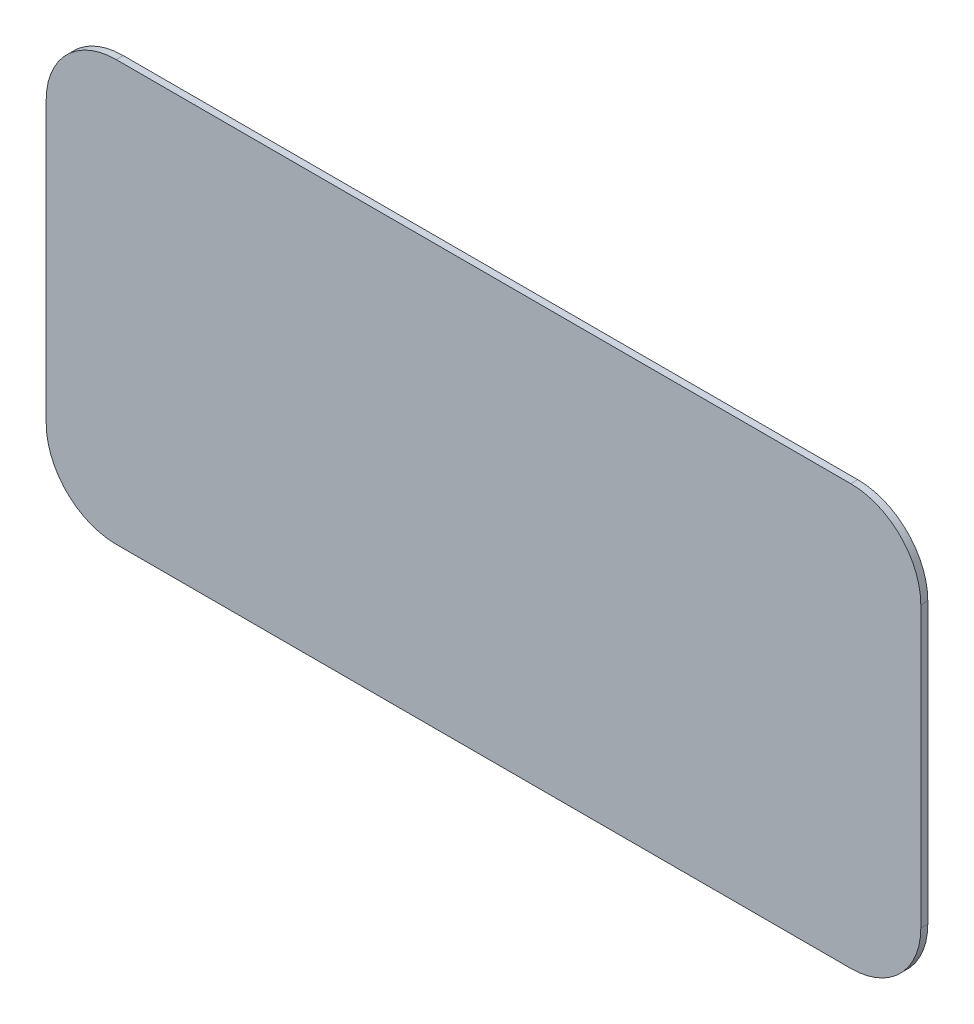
ISO-10303-21;
HEADER;
FILE_DESCRIPTION(('STEP AP214'),'2;1');
FILE_NAME('part.step','',(''),(''),'','','');
FILE_SCHEMA(('AUTOMOTIVE_DESIGN { 1 0 10303 214 1 1 1 1 }'));
ENDSEC;
DATA;
#1=APPLICATION_CONTEXT('core data for automotive mechanical design processes');
#2=APPLICATION_PROTOCOL_DEFINITION('international standard','automotive_design',2000,#1);
#3=PRODUCT_CONTEXT('',#1,'mechanical');
#4=PRODUCT('Part','Part','',(#3));
#5=PRODUCT_RELATED_PRODUCT_CATEGORY('part','',(#4));
#6=PRODUCT_DEFINITION_FORMATION('','',#4);
#7=PRODUCT_DEFINITION_CONTEXT('part definition',#1,'design');
#8=PRODUCT_DEFINITION('design','',#6,#7);
#9=PRODUCT_DEFINITION_SHAPE('','',#8);
#10=(LENGTH_UNIT() NAMED_UNIT(*) SI_UNIT(.MILLI.,.METRE.));
#11=(NAMED_UNIT(*) PLANE_ANGLE_UNIT() SI_UNIT($,.RADIAN.));
#12=(NAMED_UNIT(*) SI_UNIT($,.STERADIAN.) SOLID_ANGLE_UNIT());
#13=UNCERTAINTY_MEASURE_WITH_UNIT(LENGTH_MEASURE(1.E-05),#10,'distance_accuracy_value','');
#14=(GEOMETRIC_REPRESENTATION_CONTEXT(3) GLOBAL_UNCERTAINTY_ASSIGNED_CONTEXT((#13)) GLOBAL_UNIT_ASSIGNED_CONTEXT((#10,
#11,#12)) REPRESENTATION_CONTEXT('',''));
#15=CARTESIAN_POINT('',(0.,0.,0.));
#16=DIRECTION('',(0.,0.,1.));
#17=DIRECTION('',(1.,0.,0.));
#18=AXIS2_PLACEMENT_3D('',#15,#16,#17);
#19=CARTESIAN_POINT('',(-0.848822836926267,0.338176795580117,0.2));
#20=DIRECTION('',(0.,0.,-1.));
#21=DIRECTION('',(-1.,0.,0.));
#22=AXIS2_PLACEMENT_3D('',#19,#20,#21);
#23=CYLINDRICAL_SURFACE('',#22,2.);
#24=CARTESIAN_POINT('',(-0.848822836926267,0.338176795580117,0.));
#25=DIRECTION('',(0.,0.,1.));
#26=DIRECTION('',(-1.,0.,0.));
#27=AXIS2_PLACEMENT_3D('',#24,#25,#26);
#28=CIRCLE('',#27,2.);
#29=CARTESIAN_POINT('',(1.15117716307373,0.338176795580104,0.));
#30=VERTEX_POINT('',#29);
#31=CARTESIAN_POINT('',(-0.848822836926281,2.33817679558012,0.));
#32=VERTEX_POINT('',#31);
#33=EDGE_CURVE('E128',#30,#32,#28,.T.);
#34=ORIENTED_EDGE('',*,*,#33,.T.);
#35=DIRECTION('',(0.,0.,-1.));
#36=VECTOR('',#35,1.);
#37=CARTESIAN_POINT('',(-0.848822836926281,2.33817679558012,0.2));
#38=LINE('',#37,#36);
#39=CARTESIAN_POINT('',(-0.848822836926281,2.33817679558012,0.2));
#40=VERTEX_POINT('',#39);
#41=EDGE_CURVE('E11',#40,#32,#38,.T.);
#42=ORIENTED_EDGE('',*,*,#41,.F.);
#43=CARTESIAN_POINT('',(-0.848822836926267,0.338176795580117,0.2));
#44=DIRECTION('',(0.,0.,1.));
#45=DIRECTION('',(-1.,0.,0.));
#46=AXIS2_PLACEMENT_3D('',#43,#44,#45);
#47=CIRCLE('',#46,2.);
#48=CARTESIAN_POINT('',(1.15117716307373,0.338176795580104,0.2));
#49=VERTEX_POINT('',#48);
#50=EDGE_CURVE('E142',#49,#40,#47,.T.);
#51=ORIENTED_EDGE('',*,*,#50,.F.);
#52=DIRECTION('',(0.,0.,-1.));
#53=VECTOR('',#52,1.);
#54=CARTESIAN_POINT('',(1.15117716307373,0.338176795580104,0.2));
#55=LINE('',#54,#53);
#56=EDGE_CURVE('E124',#49,#30,#55,.T.);
#57=ORIENTED_EDGE('',*,*,#56,.T.);
#58=EDGE_LOOP('',(#34,#42,#51,#57));
#59=FACE_BOUND('',#58,.T.);
#60=ADVANCED_FACE('F32',(#59),#23,.T.);
#61=CARTESIAN_POINT('',(-21.8488228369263,2.33817679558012,0.2));
#62=DIRECTION('',(0.,-1.,0.));
#63=DIRECTION('',(0.,0.,-1.));
#64=AXIS2_PLACEMENT_3D('',#61,#62,#63);
#65=PLANE('',#64);
#66=DIRECTION('',(-1.,0.,0.));
#67=VECTOR('',#66,1.);
#68=CARTESIAN_POINT('',(-21.8488228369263,2.33817679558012,0.));
#69=LINE('',#68,#67);
#70=CARTESIAN_POINT('',(-21.8488228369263,2.33817679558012,0.));
#71=VERTEX_POINT('',#70);
#72=EDGE_CURVE('E131',#32,#71,#69,.T.);
#73=ORIENTED_EDGE('',*,*,#72,.T.);
#74=DIRECTION('',(0.,0.,-1.));
#75=VECTOR('',#74,1.);
#76=CARTESIAN_POINT('',(-21.8488228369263,2.33817679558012,0.2));
#77=LINE('',#76,#75);
#78=CARTESIAN_POINT('',(-21.8488228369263,2.33817679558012,0.2));
#79=VERTEX_POINT('',#78);
#80=EDGE_CURVE('E40',#79,#71,#77,.T.);
#81=ORIENTED_EDGE('',*,*,#80,.F.);
#82=DIRECTION('',(-1.,0.,0.));
#83=VECTOR('',#82,1.);
#84=CARTESIAN_POINT('',(-21.8488228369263,2.33817679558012,0.2));
#85=LINE('',#84,#83);
#86=EDGE_CURVE('E91',#40,#79,#85,.T.);
#87=ORIENTED_EDGE('',*,*,#86,.F.);
#88=ORIENTED_EDGE('',*,*,#41,.T.);
#89=EDGE_LOOP('',(#73,#81,#87,#88));
#90=FACE_BOUND('',#89,.T.);
#91=ADVANCED_FACE('F177',(#90),#65,.F.);
#92=CARTESIAN_POINT('',(-21.8488228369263,0.338176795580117,0.2));
#93=DIRECTION('',(0.,0.,-1.));
#94=DIRECTION('',(-1.,0.,0.));
#95=AXIS2_PLACEMENT_3D('',#92,#93,#94);
#96=CYLINDRICAL_SURFACE('',#95,2.);
#97=CARTESIAN_POINT('',(-21.8488228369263,0.338176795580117,0.));
#98=DIRECTION('',(0.,0.,1.));
#99=DIRECTION('',(-1.,0.,0.));
#100=AXIS2_PLACEMENT_3D('',#97,#98,#99);
#101=CIRCLE('',#100,2.);
#102=CARTESIAN_POINT('',(-23.8488228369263,0.338176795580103,0.));
#103=VERTEX_POINT('',#102);
#104=EDGE_CURVE('E133',#71,#103,#101,.T.);
#105=ORIENTED_EDGE('',*,*,#104,.T.);
#106=DIRECTION('',(0.,0.,-1.));
#107=VECTOR('',#106,1.);
#108=CARTESIAN_POINT('',(-23.8488228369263,0.338176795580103,0.2));
#109=LINE('',#108,#107);
#110=CARTESIAN_POINT('',(-23.8488228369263,0.338176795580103,0.2));
#111=VERTEX_POINT('',#110);
#112=EDGE_CURVE('E149',#111,#103,#109,.T.);
#113=ORIENTED_EDGE('',*,*,#112,.F.);
#114=CARTESIAN_POINT('',(-21.8488228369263,0.338176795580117,0.2));
#115=DIRECTION('',(0.,0.,1.));
#116=DIRECTION('',(-1.,0.,0.));
#117=AXIS2_PLACEMENT_3D('',#114,#115,#116);
#118=CIRCLE('',#117,2.);
#119=EDGE_CURVE('E157',#79,#111,#118,.T.);
#120=ORIENTED_EDGE('',*,*,#119,.F.);
#121=ORIENTED_EDGE('',*,*,#80,.T.);
#122=EDGE_LOOP('',(#105,#113,#120,#121));
#123=FACE_BOUND('',#122,.T.);
#124=ADVANCED_FACE('F155',(#123),#96,.T.);
#125=CARTESIAN_POINT('',(-23.8488228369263,0.338176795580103,0.2));
#126=DIRECTION('',(1.,0.,0.));
#127=DIRECTION('',(0.,0.,-1.));
#128=AXIS2_PLACEMENT_3D('',#125,#126,#127);
#129=PLANE('',#128);
#130=DIRECTION('',(0.,-1.,0.));
#131=VECTOR('',#130,1.);
#132=CARTESIAN_POINT('',(-23.8488228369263,0.338176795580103,0.));
#133=LINE('',#132,#131);
#134=CARTESIAN_POINT('',(-23.8488228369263,-7.66182320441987,0.));
#135=VERTEX_POINT('',#134);
#136=EDGE_CURVE('E135',#103,#135,#133,.T.);
#137=ORIENTED_EDGE('',*,*,#136,.T.);
#138=DIRECTION('',(0.,0.,-1.));
#139=VECTOR('',#138,1.);
#140=CARTESIAN_POINT('',(-23.8488228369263,-7.66182320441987,0.2));
#141=LINE('',#140,#139);
#142=CARTESIAN_POINT('',(-23.8488228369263,-7.66182320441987,0.2));
#143=VERTEX_POINT('',#142);
#144=EDGE_CURVE('E146',#143,#135,#141,.T.);
#145=ORIENTED_EDGE('',*,*,#144,.F.);
#146=DIRECTION('',(0.,-1.,0.));
#147=VECTOR('',#146,1.);
#148=CARTESIAN_POINT('',(-23.8488228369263,0.338176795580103,0.2));
#149=LINE('',#148,#147);
#150=EDGE_CURVE('E169',#111,#143,#149,.T.);
#151=ORIENTED_EDGE('',*,*,#150,.F.);
#152=ORIENTED_EDGE('',*,*,#112,.T.);
#153=EDGE_LOOP('',(#137,#145,#151,#152));
#154=FACE_BOUND('',#153,.T.);
#155=ADVANCED_FACE('F165',(#154),#129,.F.);
#156=CARTESIAN_POINT('',(-21.8488228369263,-7.66182320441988,0.2));
#157=DIRECTION('',(0.,0.,-1.));
#158=DIRECTION('',(-1.,0.,0.));
#159=AXIS2_PLACEMENT_3D('',#156,#157,#158);
#160=CYLINDRICAL_SURFACE('',#159,2.);
#161=CARTESIAN_POINT('',(-21.8488228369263,-7.66182320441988,0.));
#162=DIRECTION('',(0.,0.,1.));
#163=DIRECTION('',(-1.,0.,0.));
#164=AXIS2_PLACEMENT_3D('',#161,#162,#163);
#165=CIRCLE('',#164,2.);
#166=CARTESIAN_POINT('',(-21.8488228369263,-9.66182320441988,0.));
#167=VERTEX_POINT('',#166);
#168=EDGE_CURVE('E137',#135,#167,#165,.T.);
#169=ORIENTED_EDGE('',*,*,#168,.T.);
#170=DIRECTION('',(0.,0.,-1.));
#171=VECTOR('',#170,1.);
#172=CARTESIAN_POINT('',(-21.8488228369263,-9.66182320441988,0.2));
#173=LINE('',#172,#171);
#174=CARTESIAN_POINT('',(-21.8488228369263,-9.66182320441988,0.2));
#175=VERTEX_POINT('',#174);
#176=EDGE_CURVE('E119',#175,#167,#173,.T.);
#177=ORIENTED_EDGE('',*,*,#176,.F.);
#178=CARTESIAN_POINT('',(-21.8488228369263,-7.66182320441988,0.2));
#179=DIRECTION('',(0.,0.,1.));
#180=DIRECTION('',(-1.,0.,0.));
#181=AXIS2_PLACEMENT_3D('',#178,#179,#180);
#182=CIRCLE('',#181,2.);
#183=EDGE_CURVE('E110',#143,#175,#182,.T.);
#184=ORIENTED_EDGE('',*,*,#183,.F.);
#185=ORIENTED_EDGE('',*,*,#144,.T.);
#186=EDGE_LOOP('',(#169,#177,#184,#185));
#187=FACE_BOUND('',#186,.T.);
#188=ADVANCED_FACE('F168',(#187),#160,.T.);
#189=CARTESIAN_POINT('',(-21.8488228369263,-9.66182320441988,0.2));
#190=DIRECTION('',(0.,1.,0.));
#191=DIRECTION('',(0.,0.,1.));
#192=AXIS2_PLACEMENT_3D('',#189,#190,#191);
#193=PLANE('',#192);
#194=DIRECTION('',(1.,0.,0.));
#195=VECTOR('',#194,1.);
#196=CARTESIAN_POINT('',(-21.8488228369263,-9.66182320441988,0.));
#197=LINE('',#196,#195);
#198=CARTESIAN_POINT('',(-0.848822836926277,-9.66182320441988,0.));
#199=VERTEX_POINT('',#198);
#200=EDGE_CURVE('E118',#167,#199,#197,.T.);
#201=ORIENTED_EDGE('',*,*,#200,.T.);
#202=DIRECTION('',(0.,0.,-1.));
#203=VECTOR('',#202,1.);
#204=CARTESIAN_POINT('',(-0.848822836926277,-9.66182320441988,0.2));
#205=LINE('',#204,#203);
#206=CARTESIAN_POINT('',(-0.848822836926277,-9.66182320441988,0.2));
#207=VERTEX_POINT('',#206);
#208=EDGE_CURVE('E115',#207,#199,#205,.T.);
#209=ORIENTED_EDGE('',*,*,#208,.F.);
#210=DIRECTION('',(1.,0.,0.));
#211=VECTOR('',#210,1.);
#212=CARTESIAN_POINT('',(-21.8488228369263,-9.66182320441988,0.2));
#213=LINE('',#212,#211);
#214=EDGE_CURVE('E104',#175,#207,#213,.T.);
#215=ORIENTED_EDGE('',*,*,#214,.F.);
#216=ORIENTED_EDGE('',*,*,#176,.T.);
#217=EDGE_LOOP('',(#201,#209,#215,#216));
#218=FACE_BOUND('',#217,.T.);
#219=ADVANCED_FACE('F116',(#218),#193,.F.);
#220=CARTESIAN_POINT('',(-0.848822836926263,-7.66182320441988,0.2));
#221=DIRECTION('',(0.,0.,-1.));
#222=DIRECTION('',(-1.,0.,0.));
#223=AXIS2_PLACEMENT_3D('',#220,#221,#222);
#224=CYLINDRICAL_SURFACE('',#223,2.);
#225=CARTESIAN_POINT('',(-0.848822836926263,-7.66182320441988,0.));
#226=DIRECTION('',(0.,0.,1.));
#227=DIRECTION('',(-1.,0.,0.));
#228=AXIS2_PLACEMENT_3D('',#225,#226,#227);
#229=CIRCLE('',#228,2.);
#230=CARTESIAN_POINT('',(1.15117716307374,-7.66182320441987,0.));
#231=VERTEX_POINT('',#230);
#232=EDGE_CURVE('E77',#199,#231,#229,.T.);
#233=ORIENTED_EDGE('',*,*,#232,.T.);
#234=DIRECTION('',(0.,0.,-1.));
#235=VECTOR('',#234,1.);
#236=CARTESIAN_POINT('',(1.15117716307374,-7.66182320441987,0.2));
#237=LINE('',#236,#235);
#238=CARTESIAN_POINT('',(1.15117716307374,-7.66182320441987,0.2));
#239=VERTEX_POINT('',#238);
#240=EDGE_CURVE('E120',#239,#231,#237,.T.);
#241=ORIENTED_EDGE('',*,*,#240,.F.);
#242=CARTESIAN_POINT('',(-0.848822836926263,-7.66182320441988,0.2));
#243=DIRECTION('',(0.,0.,1.));
#244=DIRECTION('',(-1.,0.,0.));
#245=AXIS2_PLACEMENT_3D('',#242,#243,#244);
#246=CIRCLE('',#245,2.);
#247=EDGE_CURVE('E108',#207,#239,#246,.T.);
#248=ORIENTED_EDGE('',*,*,#247,.F.);
#249=ORIENTED_EDGE('',*,*,#208,.T.);
#250=EDGE_LOOP('',(#233,#241,#248,#249));
#251=FACE_BOUND('',#250,.T.);
#252=ADVANCED_FACE('F122',(#251),#224,.T.);
#253=CARTESIAN_POINT('',(1.15117716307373,0.338176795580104,0.2));
#254=DIRECTION('',(-1.,0.,0.));
#255=DIRECTION('',(0.,-1.,0.));
#256=AXIS2_PLACEMENT_3D('',#253,#254,#255);
#257=PLANE('',#256);
#258=DIRECTION('',(0.,1.,0.));
#259=VECTOR('',#258,1.);
#260=CARTESIAN_POINT('',(1.15117716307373,0.338176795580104,0.));
#261=LINE('',#260,#259);
#262=EDGE_CURVE('E83',#231,#30,#261,.T.);
#263=ORIENTED_EDGE('',*,*,#262,.T.);
#264=ORIENTED_EDGE('',*,*,#56,.F.);
#265=DIRECTION('',(0.,1.,0.));
#266=VECTOR('',#265,1.);
#267=CARTESIAN_POINT('',(1.15117716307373,0.338176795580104,0.2));
#268=LINE('',#267,#266);
#269=EDGE_CURVE('E48',#239,#49,#268,.T.);
#270=ORIENTED_EDGE('',*,*,#269,.F.);
#271=ORIENTED_EDGE('',*,*,#240,.T.);
#272=EDGE_LOOP('',(#263,#264,#270,#271));
#273=FACE_BOUND('',#272,.T.);
#274=ADVANCED_FACE('F193',(#273),#257,.F.);
#275=CARTESIAN_POINT('',(-0.848822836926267,0.338176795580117,0.2));
#276=DIRECTION('',(0.,0.,-1.));
#277=DIRECTION('',(-1.,0.,0.));
#278=AXIS2_PLACEMENT_3D('',#275,#276,#277);
#279=PLANE('',#278);
#280=ORIENTED_EDGE('',*,*,#50,.T.);
#281=ORIENTED_EDGE('',*,*,#86,.T.);
#282=ORIENTED_EDGE('',*,*,#119,.T.);
#283=ORIENTED_EDGE('',*,*,#150,.T.);
#284=ORIENTED_EDGE('',*,*,#183,.T.);
#285=ORIENTED_EDGE('',*,*,#214,.T.);
#286=ORIENTED_EDGE('',*,*,#247,.T.);
#287=ORIENTED_EDGE('',*,*,#269,.T.);
#288=EDGE_LOOP('',(#280,#281,#282,#283,#284,#285,#286,#287));
#289=FACE_BOUND('',#288,.T.);
#290=ADVANCED_FACE('F106',(#289),#279,.F.);
#291=CARTESIAN_POINT('',(-0.848822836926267,0.338176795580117,0.));
#292=DIRECTION('',(0.,0.,-1.));
#293=DIRECTION('',(-1.,0.,0.));
#294=AXIS2_PLACEMENT_3D('',#291,#292,#293);
#295=PLANE('',#294);
#296=ORIENTED_EDGE('',*,*,#33,.F.);
#297=ORIENTED_EDGE('',*,*,#262,.F.);
#298=ORIENTED_EDGE('',*,*,#232,.F.);
#299=ORIENTED_EDGE('',*,*,#200,.F.);
#300=ORIENTED_EDGE('',*,*,#168,.F.);
#301=ORIENTED_EDGE('',*,*,#136,.F.);
#302=ORIENTED_EDGE('',*,*,#104,.F.);
#303=ORIENTED_EDGE('',*,*,#72,.F.);
#304=EDGE_LOOP('',(#296,#297,#298,#299,#300,#301,#302,#303));
#305=FACE_BOUND('',#304,.T.);
#306=ADVANCED_FACE('F161',(#305),#295,.T.);
#307=CLOSED_SHELL('',(#60,#91,#124,#155,#188,#219,#252,#274,#290,#306));
#308=MANIFOLD_SOLID_BREP('B2',#307);
#309=ADVANCED_BREP_SHAPE_REPRESENTATION('',(#18,#308),#14);
#310=SHAPE_DEFINITION_REPRESENTATION(#9,#309);
ENDSEC;
END-ISO-10303-21;
